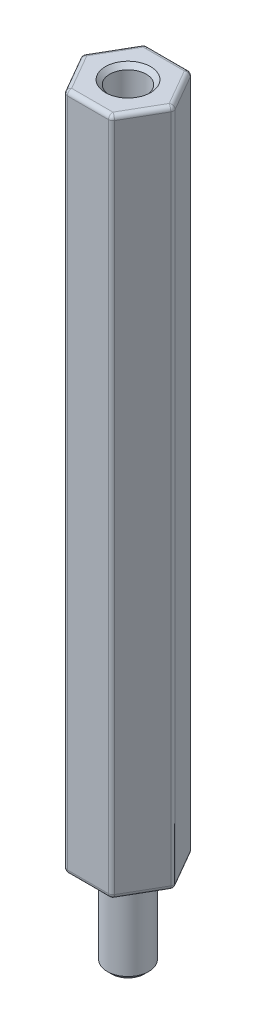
ISO-10303-21;
HEADER;
FILE_DESCRIPTION(('STEP AP214'),'2;1');
FILE_NAME('part.step','',(''),(''),'','','');
FILE_SCHEMA(('AUTOMOTIVE_DESIGN { 1 0 10303 214 1 1 1 1 }'));
ENDSEC;
DATA;
#1=APPLICATION_CONTEXT('core data for automotive mechanical design processes');
#2=APPLICATION_PROTOCOL_DEFINITION('international standard','automotive_design',2000,#1);
#3=PRODUCT_CONTEXT('',#1,'mechanical');
#4=PRODUCT('Part','Part','',(#3));
#5=PRODUCT_RELATED_PRODUCT_CATEGORY('part','',(#4));
#6=PRODUCT_DEFINITION_FORMATION('','',#4);
#7=PRODUCT_DEFINITION_CONTEXT('part definition',#1,'design');
#8=PRODUCT_DEFINITION('design','',#6,#7);
#9=PRODUCT_DEFINITION_SHAPE('','',#8);
#10=(LENGTH_UNIT() NAMED_UNIT(*) SI_UNIT(.MILLI.,.METRE.));
#11=(NAMED_UNIT(*) PLANE_ANGLE_UNIT() SI_UNIT($,.RADIAN.));
#12=(NAMED_UNIT(*) SI_UNIT($,.STERADIAN.) SOLID_ANGLE_UNIT());
#13=UNCERTAINTY_MEASURE_WITH_UNIT(LENGTH_MEASURE(1.E-05),#10,'distance_accuracy_value','');
#14=(GEOMETRIC_REPRESENTATION_CONTEXT(3) GLOBAL_UNCERTAINTY_ASSIGNED_CONTEXT((#13)) GLOBAL_UNIT_ASSIGNED_CONTEXT((#10,
#11,#12)) REPRESENTATION_CONTEXT('',''));
#15=CARTESIAN_POINT('',(0.,0.,0.));
#16=DIRECTION('',(0.,0.,1.));
#17=DIRECTION('',(1.,0.,0.));
#18=AXIS2_PLACEMENT_3D('',#15,#16,#17);
#19=CARTESIAN_POINT('',(0.,46.6,0.));
#20=DIRECTION('',(0.,1.,0.));
#21=DIRECTION('',(0.,0.,1.));
#22=AXIS2_PLACEMENT_3D('',#19,#20,#21);
#23=PLANE('',#22);
#24=CARTESIAN_POINT('',(0.,46.6,0.));
#25=DIRECTION('',(0.,1.,0.));
#26=DIRECTION('',(0.,0.,1.));
#27=AXIS2_PLACEMENT_3D('',#24,#25,#26);
#28=CIRCLE('',#27,1.55000000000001);
#29=CARTESIAN_POINT('',(0.,46.6,1.55000000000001));
#30=VERTEX_POINT('',#29);
#31=EDGE_CURVE('E319',#30,#30,#28,.F.);
#32=ORIENTED_EDGE('',*,*,#31,.T.);
#33=EDGE_LOOP('',(#32));
#34=FACE_BOUND('',#33,.T.);
#35=DIRECTION('',(-0.5,0.,0.866025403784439));
#36=VECTOR('',#35,1.);
#37=CARTESIAN_POINT('',(-2.82901631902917,46.6,0.));
#38=LINE('',#37,#36);
#39=CARTESIAN_POINT('',(-1.41450815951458,46.6,-2.45));
#40=VERTEX_POINT('',#39);
#41=CARTESIAN_POINT('',(-2.82901631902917,46.6,0.));
#42=VERTEX_POINT('',#41);
#43=EDGE_CURVE('E63',#40,#42,#38,.T.);
#44=ORIENTED_EDGE('',*,*,#43,.T.);
#45=DIRECTION('',(0.5,0.,0.866025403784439));
#46=VECTOR('',#45,1.);
#47=CARTESIAN_POINT('',(-1.41450815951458,46.6,2.45));
#48=LINE('',#47,#46);
#49=CARTESIAN_POINT('',(-1.41450815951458,46.6,2.45));
#50=VERTEX_POINT('',#49);
#51=EDGE_CURVE('E646',#42,#50,#48,.T.);
#52=ORIENTED_EDGE('',*,*,#51,.T.);
#53=DIRECTION('',(1.,0.,0.));
#54=VECTOR('',#53,1.);
#55=CARTESIAN_POINT('',(1.41450815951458,46.6,2.45));
#56=LINE('',#55,#54);
#57=CARTESIAN_POINT('',(1.41450815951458,46.6,2.45));
#58=VERTEX_POINT('',#57);
#59=EDGE_CURVE('E633',#50,#58,#56,.T.);
#60=ORIENTED_EDGE('',*,*,#59,.T.);
#61=DIRECTION('',(0.5,0.,-0.866025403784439));
#62=VECTOR('',#61,1.);
#63=CARTESIAN_POINT('',(2.82901631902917,46.6,0.));
#64=LINE('',#63,#62);
#65=CARTESIAN_POINT('',(2.82901631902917,46.6,0.));
#66=VERTEX_POINT('',#65);
#67=EDGE_CURVE('E636',#58,#66,#64,.T.);
#68=ORIENTED_EDGE('',*,*,#67,.T.);
#69=DIRECTION('',(-0.5,0.,-0.866025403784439));
#70=VECTOR('',#69,1.);
#71=CARTESIAN_POINT('',(1.41450815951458,46.6,-2.45));
#72=LINE('',#71,#70);
#73=CARTESIAN_POINT('',(1.41450815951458,46.6,-2.45));
#74=VERTEX_POINT('',#73);
#75=EDGE_CURVE('E639',#66,#74,#72,.T.);
#76=ORIENTED_EDGE('',*,*,#75,.T.);
#77=DIRECTION('',(-1.,0.,0.));
#78=VECTOR('',#77,1.);
#79=CARTESIAN_POINT('',(-1.41450815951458,46.6,-2.45));
#80=LINE('',#79,#78);
#81=EDGE_CURVE('E68',#74,#40,#80,.T.);
#82=ORIENTED_EDGE('',*,*,#81,.T.);
#83=EDGE_LOOP('',(#44,#52,#60,#68,#76,#82));
#84=FACE_BOUND('',#83,.T.);
#85=ADVANCED_FACE('F47',(#34,#84),#23,.T.);
#86=CARTESIAN_POINT('',(0.,0.,0.));
#87=DIRECTION('',(0.,1.,0.));
#88=DIRECTION('',(0.,0.,1.));
#89=AXIS2_PLACEMENT_3D('',#86,#87,#88);
#90=PLANE('',#89);
#91=CARTESIAN_POINT('',(0.,0.,0.));
#92=DIRECTION('',(0.,1.,0.));
#93=DIRECTION('',(0.,0.,1.));
#94=AXIS2_PLACEMENT_3D('',#91,#92,#93);
#95=CIRCLE('',#94,1.725);
#96=CARTESIAN_POINT('',(0.,0.,1.725));
#97=VERTEX_POINT('',#96);
#98=EDGE_CURVE('E11',#97,#97,#95,.T.);
#99=ORIENTED_EDGE('',*,*,#98,.T.);
#100=EDGE_LOOP('',(#99));
#101=FACE_BOUND('',#100,.T.);
#102=DIRECTION('',(1.,0.,0.));
#103=VECTOR('',#102,1.);
#104=CARTESIAN_POINT('',(0.,0.,2.45));
#105=LINE('',#104,#103);
#106=CARTESIAN_POINT('',(1.41450815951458,0.,2.45));
#107=VERTEX_POINT('',#106);
#108=CARTESIAN_POINT('',(-1.41450815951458,0.,2.45));
#109=VERTEX_POINT('',#108);
#110=EDGE_CURVE('E184',#107,#109,#105,.F.);
#111=ORIENTED_EDGE('',*,*,#110,.T.);
#112=DIRECTION('',(0.5,0.,0.866025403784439));
#113=VECTOR('',#112,1.);
#114=CARTESIAN_POINT('',(-2.12176223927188,0.,1.225));
#115=LINE('',#114,#113);
#116=CARTESIAN_POINT('',(-2.82901631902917,0.,0.));
#117=VERTEX_POINT('',#116);
#118=EDGE_CURVE('E212',#109,#117,#115,.F.);
#119=ORIENTED_EDGE('',*,*,#118,.T.);
#120=DIRECTION('',(-0.5,0.,0.866025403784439));
#121=VECTOR('',#120,1.);
#122=CARTESIAN_POINT('',(-2.12176223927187,0.,-1.225));
#123=LINE('',#122,#121);
#124=CARTESIAN_POINT('',(-1.41450815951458,0.,-2.45));
#125=VERTEX_POINT('',#124);
#126=EDGE_CURVE('E574',#117,#125,#123,.F.);
#127=ORIENTED_EDGE('',*,*,#126,.T.);
#128=DIRECTION('',(-1.,0.,0.));
#129=VECTOR('',#128,1.);
#130=CARTESIAN_POINT('',(0.,0.,-2.45));
#131=LINE('',#130,#129);
#132=CARTESIAN_POINT('',(1.41450815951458,0.,-2.45));
#133=VERTEX_POINT('',#132);
#134=EDGE_CURVE('E571',#125,#133,#131,.F.);
#135=ORIENTED_EDGE('',*,*,#134,.T.);
#136=DIRECTION('',(-0.5,0.,-0.866025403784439));
#137=VECTOR('',#136,1.);
#138=CARTESIAN_POINT('',(2.12176223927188,0.,-1.225));
#139=LINE('',#138,#137);
#140=CARTESIAN_POINT('',(2.82901631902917,0.,0.));
#141=VERTEX_POINT('',#140);
#142=EDGE_CURVE('E568',#133,#141,#139,.F.);
#143=ORIENTED_EDGE('',*,*,#142,.T.);
#144=DIRECTION('',(0.5,0.,-0.866025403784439));
#145=VECTOR('',#144,1.);
#146=CARTESIAN_POINT('',(2.12176223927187,0.,1.225));
#147=LINE('',#146,#145);
#148=EDGE_CURVE('E565',#141,#107,#147,.F.);
#149=ORIENTED_EDGE('',*,*,#148,.T.);
#150=EDGE_LOOP('',(#111,#119,#127,#135,#143,#149));
#151=FACE_BOUND('',#150,.T.);
#152=ADVANCED_FACE('F339',(#101,#151),#90,.F.);
#153=CARTESIAN_POINT('',(1.58771324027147,46.6,-2.75));
#154=DIRECTION('',(0.,0.,1.));
#155=DIRECTION('',(1.,0.,0.));
#156=AXIS2_PLACEMENT_3D('',#153,#154,#155);
#157=PLANE('',#156);
#158=DIRECTION('',(0.,-1.,0.));
#159=VECTOR('',#158,1.);
#160=CARTESIAN_POINT('',(1.41450815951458,46.6,-2.75));
#161=LINE('',#160,#159);
#162=CARTESIAN_POINT('',(1.41450815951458,46.3,-2.75));
#163=VERTEX_POINT('',#162);
#164=CARTESIAN_POINT('',(1.41450815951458,0.300000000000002,-2.75));
#165=VERTEX_POINT('',#164);
#166=EDGE_CURVE('E521',#163,#165,#161,.T.);
#167=ORIENTED_EDGE('',*,*,#166,.T.);
#168=DIRECTION('',(-1.,0.,0.));
#169=VECTOR('',#168,1.);
#170=CARTESIAN_POINT('',(1.58771324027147,0.300000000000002,-2.75));
#171=LINE('',#170,#169);
#172=CARTESIAN_POINT('',(-1.41450815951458,0.300000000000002,-2.75));
#173=VERTEX_POINT('',#172);
#174=EDGE_CURVE('E600',#165,#173,#171,.T.);
#175=ORIENTED_EDGE('',*,*,#174,.T.);
#176=DIRECTION('',(0.,-1.,0.));
#177=VECTOR('',#176,1.);
#178=CARTESIAN_POINT('',(-1.41450815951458,46.6,-2.75));
#179=LINE('',#178,#177);
#180=CARTESIAN_POINT('',(-1.41450815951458,46.3,-2.75));
#181=VERTEX_POINT('',#180);
#182=EDGE_CURVE('E517',#173,#181,#179,.F.);
#183=ORIENTED_EDGE('',*,*,#182,.T.);
#184=DIRECTION('',(-1.,0.,0.));
#185=VECTOR('',#184,1.);
#186=CARTESIAN_POINT('',(1.41450815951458,46.3,-2.75));
#187=LINE('',#186,#185);
#188=EDGE_CURVE('E597',#181,#163,#187,.F.);
#189=ORIENTED_EDGE('',*,*,#188,.T.);
#190=EDGE_LOOP('',(#167,#175,#183,#189));
#191=FACE_BOUND('',#190,.T.);
#192=ADVANCED_FACE('F345',(#191),#157,.F.);
#193=CARTESIAN_POINT('',(-1.58771324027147,46.6,-2.75));
#194=DIRECTION('',(0.866025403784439,0.,0.5));
#195=DIRECTION('',(0.5,0.,-0.866025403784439));
#196=AXIS2_PLACEMENT_3D('',#193,#194,#195);
#197=PLANE('',#196);
#198=DIRECTION('',(0.,-1.,0.));
#199=VECTOR('',#198,1.);
#200=CARTESIAN_POINT('',(-1.67431578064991,46.6,-2.6));
#201=LINE('',#200,#199);
#202=CARTESIAN_POINT('',(-1.67431578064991,46.3,-2.6));
#203=VERTEX_POINT('',#202);
#204=CARTESIAN_POINT('',(-1.67431578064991,0.300000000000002,-2.6));
#205=VERTEX_POINT('',#204);
#206=EDGE_CURVE('E198',#203,#205,#201,.T.);
#207=ORIENTED_EDGE('',*,*,#206,.T.);
#208=DIRECTION('',(-0.5,0.,0.866025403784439));
#209=VECTOR('',#208,1.);
#210=CARTESIAN_POINT('',(-1.58771324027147,0.300000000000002,-2.75));
#211=LINE('',#210,#209);
#212=CARTESIAN_POINT('',(-3.0888239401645,0.300000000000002,-0.15));
#213=VERTEX_POINT('',#212);
#214=EDGE_CURVE('E588',#205,#213,#211,.T.);
#215=ORIENTED_EDGE('',*,*,#214,.T.);
#216=DIRECTION('',(0.,-1.,0.));
#217=VECTOR('',#216,1.);
#218=CARTESIAN_POINT('',(-3.0888239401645,46.6,-0.15));
#219=LINE('',#218,#217);
#220=CARTESIAN_POINT('',(-3.0888239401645,46.3,-0.15));
#221=VERTEX_POINT('',#220);
#222=EDGE_CURVE('E543',#213,#221,#219,.F.);
#223=ORIENTED_EDGE('',*,*,#222,.T.);
#224=DIRECTION('',(-0.5,0.,0.866025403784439));
#225=VECTOR('',#224,1.);
#226=CARTESIAN_POINT('',(-1.67431578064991,46.3,-2.6));
#227=LINE('',#226,#225);
#228=EDGE_CURVE('E585',#221,#203,#227,.F.);
#229=ORIENTED_EDGE('',*,*,#228,.T.);
#230=EDGE_LOOP('',(#207,#215,#223,#229));
#231=FACE_BOUND('',#230,.T.);
#232=ADVANCED_FACE('F366',(#231),#197,.F.);
#233=CARTESIAN_POINT('',(-3.17542648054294,46.6,0.));
#234=DIRECTION('',(0.866025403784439,0.,-0.5));
#235=DIRECTION('',(-0.5,0.,-0.866025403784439));
#236=AXIS2_PLACEMENT_3D('',#233,#234,#235);
#237=PLANE('',#236);
#238=DIRECTION('',(0.,-1.,0.));
#239=VECTOR('',#238,1.);
#240=CARTESIAN_POINT('',(-3.0888239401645,46.6,0.15));
#241=LINE('',#240,#239);
#242=CARTESIAN_POINT('',(-3.0888239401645,46.3,0.15));
#243=VERTEX_POINT('',#242);
#244=CARTESIAN_POINT('',(-3.0888239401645,0.300000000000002,0.15));
#245=VERTEX_POINT('',#244);
#246=EDGE_CURVE('E179',#243,#245,#241,.T.);
#247=ORIENTED_EDGE('',*,*,#246,.T.);
#248=DIRECTION('',(0.5,0.,0.866025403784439));
#249=VECTOR('',#248,1.);
#250=CARTESIAN_POINT('',(-3.17542648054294,0.300000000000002,0.));
#251=LINE('',#250,#249);
#252=CARTESIAN_POINT('',(-1.67431578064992,0.300000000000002,2.6));
#253=VERTEX_POINT('',#252);
#254=EDGE_CURVE('E174',#245,#253,#251,.T.);
#255=ORIENTED_EDGE('',*,*,#254,.T.);
#256=DIRECTION('',(0.,-1.,0.));
#257=VECTOR('',#256,1.);
#258=CARTESIAN_POINT('',(-1.67431578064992,46.6,2.6));
#259=LINE('',#258,#257);
#260=CARTESIAN_POINT('',(-1.67431578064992,46.3,2.6));
#261=VERTEX_POINT('',#260);
#262=EDGE_CURVE('E177',#253,#261,#259,.F.);
#263=ORIENTED_EDGE('',*,*,#262,.T.);
#264=DIRECTION('',(0.5,0.,0.866025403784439));
#265=VECTOR('',#264,1.);
#266=CARTESIAN_POINT('',(-3.0888239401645,46.3,0.15));
#267=LINE('',#266,#265);
#268=EDGE_CURVE('E185',#261,#243,#267,.F.);
#269=ORIENTED_EDGE('',*,*,#268,.T.);
#270=EDGE_LOOP('',(#247,#255,#263,#269));
#271=FACE_BOUND('',#270,.T.);
#272=ADVANCED_FACE('F176',(#271),#237,.F.);
#273=CARTESIAN_POINT('',(-1.58771324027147,46.6,2.75));
#274=DIRECTION('',(0.,0.,-1.));
#275=DIRECTION('',(-1.,0.,0.));
#276=AXIS2_PLACEMENT_3D('',#273,#274,#275);
#277=PLANE('',#276);
#278=DIRECTION('',(0.,-1.,0.));
#279=VECTOR('',#278,1.);
#280=CARTESIAN_POINT('',(-1.41450815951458,46.6,2.75));
#281=LINE('',#280,#279);
#282=CARTESIAN_POINT('',(-1.41450815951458,46.3,2.75));
#283=VERTEX_POINT('',#282);
#284=CARTESIAN_POINT('',(-1.41450815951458,0.300000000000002,2.75));
#285=VERTEX_POINT('',#284);
#286=EDGE_CURVE('E556',#283,#285,#281,.T.);
#287=ORIENTED_EDGE('',*,*,#286,.T.);
#288=DIRECTION('',(1.,0.,0.));
#289=VECTOR('',#288,1.);
#290=CARTESIAN_POINT('',(-1.58771324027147,0.300000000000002,2.75));
#291=LINE('',#290,#289);
#292=CARTESIAN_POINT('',(1.41450815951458,0.300000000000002,2.75));
#293=VERTEX_POINT('',#292);
#294=EDGE_CURVE('E224',#285,#293,#291,.T.);
#295=ORIENTED_EDGE('',*,*,#294,.T.);
#296=DIRECTION('',(0.,-1.,0.));
#297=VECTOR('',#296,1.);
#298=CARTESIAN_POINT('',(1.41450815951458,46.6,2.75));
#299=LINE('',#298,#297);
#300=CARTESIAN_POINT('',(1.41450815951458,46.3,2.75));
#301=VERTEX_POINT('',#300);
#302=EDGE_CURVE('E552',#293,#301,#299,.F.);
#303=ORIENTED_EDGE('',*,*,#302,.T.);
#304=DIRECTION('',(1.,0.,0.));
#305=VECTOR('',#304,1.);
#306=CARTESIAN_POINT('',(-1.41450815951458,46.3,2.75));
#307=LINE('',#306,#305);
#308=EDGE_CURVE('E648',#301,#283,#307,.F.);
#309=ORIENTED_EDGE('',*,*,#308,.T.);
#310=EDGE_LOOP('',(#287,#295,#303,#309));
#311=FACE_BOUND('',#310,.T.);
#312=ADVANCED_FACE('F359',(#311),#277,.F.);
#313=CARTESIAN_POINT('',(1.58771324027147,46.6,2.75));
#314=DIRECTION('',(-0.866025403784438,0.,-0.5));
#315=DIRECTION('',(-0.5,0.,0.866025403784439));
#316=AXIS2_PLACEMENT_3D('',#313,#314,#315);
#317=PLANE('',#316);
#318=DIRECTION('',(0.,-1.,0.));
#319=VECTOR('',#318,1.);
#320=CARTESIAN_POINT('',(1.67431578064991,46.6,2.6));
#321=LINE('',#320,#319);
#322=CARTESIAN_POINT('',(1.67431578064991,46.3,2.6));
#323=VERTEX_POINT('',#322);
#324=CARTESIAN_POINT('',(1.67431578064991,0.300000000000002,2.6));
#325=VERTEX_POINT('',#324);
#326=EDGE_CURVE('E535',#323,#325,#321,.T.);
#327=ORIENTED_EDGE('',*,*,#326,.T.);
#328=DIRECTION('',(0.5,0.,-0.866025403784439));
#329=VECTOR('',#328,1.);
#330=CARTESIAN_POINT('',(1.58771324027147,0.300000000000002,2.75));
#331=LINE('',#330,#329);
#332=CARTESIAN_POINT('',(3.0888239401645,0.300000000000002,0.149999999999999));
#333=VERTEX_POINT('',#332);
#334=EDGE_CURVE('E624',#325,#333,#331,.T.);
#335=ORIENTED_EDGE('',*,*,#334,.T.);
#336=DIRECTION('',(0.,-1.,0.));
#337=VECTOR('',#336,1.);
#338=CARTESIAN_POINT('',(3.0888239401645,46.6,0.149999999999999));
#339=LINE('',#338,#337);
#340=CARTESIAN_POINT('',(3.0888239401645,46.3,0.149999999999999));
#341=VERTEX_POINT('',#340);
#342=EDGE_CURVE('E539',#333,#341,#339,.F.);
#343=ORIENTED_EDGE('',*,*,#342,.T.);
#344=DIRECTION('',(0.5,0.,-0.866025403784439));
#345=VECTOR('',#344,1.);
#346=CARTESIAN_POINT('',(1.67431578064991,46.3,2.6));
#347=LINE('',#346,#345);
#348=EDGE_CURVE('E621',#341,#323,#347,.F.);
#349=ORIENTED_EDGE('',*,*,#348,.T.);
#350=EDGE_LOOP('',(#327,#335,#343,#349));
#351=FACE_BOUND('',#350,.T.);
#352=ADVANCED_FACE('F355',(#351),#317,.F.);
#353=CARTESIAN_POINT('',(3.17542648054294,46.6,0.));
#354=DIRECTION('',(-0.866025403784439,0.,0.5));
#355=DIRECTION('',(0.5,0.,0.866025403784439));
#356=AXIS2_PLACEMENT_3D('',#353,#354,#355);
#357=PLANE('',#356);
#358=DIRECTION('',(0.,-1.,0.));
#359=VECTOR('',#358,1.);
#360=CARTESIAN_POINT('',(3.0888239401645,46.6,-0.150000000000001));
#361=LINE('',#360,#359);
#362=CARTESIAN_POINT('',(3.0888239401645,46.3,-0.150000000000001));
#363=VERTEX_POINT('',#362);
#364=CARTESIAN_POINT('',(3.0888239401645,0.300000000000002,-0.150000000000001));
#365=VERTEX_POINT('',#364);
#366=EDGE_CURVE('E527',#363,#365,#361,.T.);
#367=ORIENTED_EDGE('',*,*,#366,.T.);
#368=DIRECTION('',(-0.5,0.,-0.866025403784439));
#369=VECTOR('',#368,1.);
#370=CARTESIAN_POINT('',(3.17542648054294,0.300000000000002,0.));
#371=LINE('',#370,#369);
#372=CARTESIAN_POINT('',(1.67431578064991,0.300000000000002,-2.6));
#373=VERTEX_POINT('',#372);
#374=EDGE_CURVE('E612',#365,#373,#371,.T.);
#375=ORIENTED_EDGE('',*,*,#374,.T.);
#376=DIRECTION('',(0.,-1.,0.));
#377=VECTOR('',#376,1.);
#378=CARTESIAN_POINT('',(1.67431578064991,46.6,-2.6));
#379=LINE('',#378,#377);
#380=CARTESIAN_POINT('',(1.67431578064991,46.3,-2.6));
#381=VERTEX_POINT('',#380);
#382=EDGE_CURVE('E531',#373,#381,#379,.F.);
#383=ORIENTED_EDGE('',*,*,#382,.T.);
#384=DIRECTION('',(-0.5,0.,-0.866025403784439));
#385=VECTOR('',#384,1.);
#386=CARTESIAN_POINT('',(3.0888239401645,46.3,-0.150000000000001));
#387=LINE('',#386,#385);
#388=EDGE_CURVE('E609',#381,#363,#387,.F.);
#389=ORIENTED_EDGE('',*,*,#388,.T.);
#390=EDGE_LOOP('',(#367,#375,#383,#389));
#391=FACE_BOUND('',#390,.T.);
#392=ADVANCED_FACE('F352',(#391),#357,.F.);
#393=CARTESIAN_POINT('',(0.,46.6,0.));
#394=DIRECTION('',(0.,-1.,0.));
#395=DIRECTION('',(0.,0.,-1.));
#396=AXIS2_PLACEMENT_3D('',#393,#394,#395);
#397=CYLINDRICAL_SURFACE('',#396,1.25);
#398=CARTESIAN_POINT('',(0.,46.3,0.));
#399=DIRECTION('',(0.,1.,0.));
#400=DIRECTION('',(0.,0.,1.));
#401=AXIS2_PLACEMENT_3D('',#398,#399,#400);
#402=CIRCLE('',#401,1.25);
#403=CARTESIAN_POINT('',(0.,46.3,1.25));
#404=VERTEX_POINT('',#403);
#405=EDGE_CURVE('E315',#404,#404,#402,.T.);
#406=ORIENTED_EDGE('',*,*,#405,.T.);
#407=EDGE_LOOP('',(#406));
#408=FACE_BOUND('',#407,.T.);
#409=CARTESIAN_POINT('',(0.,0.,0.));
#410=DIRECTION('',(0.,1.,0.));
#411=DIRECTION('',(0.,0.,1.));
#412=AXIS2_PLACEMENT_3D('',#409,#410,#411);
#413=CIRCLE('',#412,1.25);
#414=CARTESIAN_POINT('',(0.,0.,1.25));
#415=VERTEX_POINT('',#414);
#416=EDGE_CURVE('E265',#415,#415,#413,.T.);
#417=ORIENTED_EDGE('',*,*,#416,.F.);
#418=EDGE_LOOP('',(#417));
#419=FACE_BOUND('',#418,.T.);
#420=ADVANCED_FACE('F349',(#408,#419),#397,.F.);
#421=CARTESIAN_POINT('',(1.41450815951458,46.6,-2.45));
#422=DIRECTION('',(0.,-1.,0.));
#423=DIRECTION('',(0.,0.,-1.));
#424=AXIS2_PLACEMENT_3D('',#421,#422,#423);
#425=CYLINDRICAL_SURFACE('',#424,0.3);
#426=ORIENTED_EDGE('',*,*,#382,.F.);
#427=CARTESIAN_POINT('',(1.41450815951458,0.300000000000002,-2.45));
#428=DIRECTION('',(0.,-1.,0.));
#429=DIRECTION('',(0.,0.,-1.));
#430=AXIS2_PLACEMENT_3D('',#427,#428,#429);
#431=CIRCLE('',#430,0.3);
#432=EDGE_CURVE('E606',#373,#165,#431,.F.);
#433=ORIENTED_EDGE('',*,*,#432,.T.);
#434=ORIENTED_EDGE('',*,*,#166,.F.);
#435=CARTESIAN_POINT('',(1.41450815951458,46.3,-2.45));
#436=DIRECTION('',(0.,-1.,0.));
#437=DIRECTION('',(0.,0.,-1.));
#438=AXIS2_PLACEMENT_3D('',#435,#436,#437);
#439=CIRCLE('',#438,0.3);
#440=EDGE_CURVE('E603',#163,#381,#439,.T.);
#441=ORIENTED_EDGE('',*,*,#440,.T.);
#442=EDGE_LOOP('',(#426,#433,#434,#441));
#443=FACE_BOUND('',#442,.T.);
#444=ADVANCED_FACE('F373',(#443),#425,.T.);
#445=CARTESIAN_POINT('',(2.82901631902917,46.6,0.));
#446=DIRECTION('',(0.,-1.,0.));
#447=DIRECTION('',(0.,0.,-1.));
#448=AXIS2_PLACEMENT_3D('',#445,#446,#447);
#449=CYLINDRICAL_SURFACE('',#448,0.3);
#450=ORIENTED_EDGE('',*,*,#342,.F.);
#451=CARTESIAN_POINT('',(2.82901631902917,0.300000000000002,0.));
#452=DIRECTION('',(0.,-1.,0.));
#453=DIRECTION('',(0.,0.,-1.));
#454=AXIS2_PLACEMENT_3D('',#451,#452,#453);
#455=CIRCLE('',#454,0.3);
#456=EDGE_CURVE('E618',#333,#365,#455,.F.);
#457=ORIENTED_EDGE('',*,*,#456,.T.);
#458=ORIENTED_EDGE('',*,*,#366,.F.);
#459=CARTESIAN_POINT('',(2.82901631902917,46.3,0.));
#460=DIRECTION('',(0.,-1.,0.));
#461=DIRECTION('',(0.,0.,-1.));
#462=AXIS2_PLACEMENT_3D('',#459,#460,#461);
#463=CIRCLE('',#462,0.3);
#464=EDGE_CURVE('E615',#363,#341,#463,.T.);
#465=ORIENTED_EDGE('',*,*,#464,.T.);
#466=EDGE_LOOP('',(#450,#457,#458,#465));
#467=FACE_BOUND('',#466,.T.);
#468=ADVANCED_FACE('F376',(#467),#449,.T.);
#469=CARTESIAN_POINT('',(-1.41450815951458,46.6,-2.45));
#470=DIRECTION('',(0.,-1.,0.));
#471=DIRECTION('',(0.,0.,-1.));
#472=AXIS2_PLACEMENT_3D('',#469,#470,#471);
#473=CYLINDRICAL_SURFACE('',#472,0.3);
#474=ORIENTED_EDGE('',*,*,#182,.F.);
#475=CARTESIAN_POINT('',(-1.41450815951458,0.300000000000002,-2.45));
#476=DIRECTION('',(0.,-1.,0.));
#477=DIRECTION('',(0.,0.,-1.));
#478=AXIS2_PLACEMENT_3D('',#475,#476,#477);
#479=CIRCLE('',#478,0.3);
#480=EDGE_CURVE('E594',#173,#205,#479,.F.);
#481=ORIENTED_EDGE('',*,*,#480,.T.);
#482=ORIENTED_EDGE('',*,*,#206,.F.);
#483=CARTESIAN_POINT('',(-1.41450815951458,46.3,-2.45));
#484=DIRECTION('',(0.,-1.,0.));
#485=DIRECTION('',(0.,0.,-1.));
#486=AXIS2_PLACEMENT_3D('',#483,#484,#485);
#487=CIRCLE('',#486,0.3);
#488=EDGE_CURVE('E591',#203,#181,#487,.T.);
#489=ORIENTED_EDGE('',*,*,#488,.T.);
#490=EDGE_LOOP('',(#474,#481,#482,#489));
#491=FACE_BOUND('',#490,.T.);
#492=ADVANCED_FACE('F380',(#491),#473,.T.);
#493=CARTESIAN_POINT('',(-2.82901631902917,46.6,0.));
#494=DIRECTION('',(0.,-1.,0.));
#495=DIRECTION('',(0.,0.,-1.));
#496=AXIS2_PLACEMENT_3D('',#493,#494,#495);
#497=CYLINDRICAL_SURFACE('',#496,0.3);
#498=ORIENTED_EDGE('',*,*,#222,.F.);
#499=CARTESIAN_POINT('',(-2.82901631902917,0.300000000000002,0.));
#500=DIRECTION('',(0.,-1.,0.));
#501=DIRECTION('',(0.,0.,-1.));
#502=AXIS2_PLACEMENT_3D('',#499,#500,#501);
#503=CIRCLE('',#502,0.3);
#504=EDGE_CURVE('E582',#213,#245,#503,.F.);
#505=ORIENTED_EDGE('',*,*,#504,.T.);
#506=ORIENTED_EDGE('',*,*,#246,.F.);
#507=CARTESIAN_POINT('',(-2.82901631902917,46.3,0.));
#508=DIRECTION('',(0.,-1.,0.));
#509=DIRECTION('',(0.,0.,-1.));
#510=AXIS2_PLACEMENT_3D('',#507,#508,#509);
#511=CIRCLE('',#510,0.3);
#512=EDGE_CURVE('E579',#243,#221,#511,.T.);
#513=ORIENTED_EDGE('',*,*,#512,.T.);
#514=EDGE_LOOP('',(#498,#505,#506,#513));
#515=FACE_BOUND('',#514,.T.);
#516=ADVANCED_FACE('F384',(#515),#497,.T.);
#517=CARTESIAN_POINT('',(-1.41450815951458,46.6,2.45));
#518=DIRECTION('',(0.,-1.,0.));
#519=DIRECTION('',(0.,0.,-1.));
#520=AXIS2_PLACEMENT_3D('',#517,#518,#519);
#521=CYLINDRICAL_SURFACE('',#520,0.3);
#522=ORIENTED_EDGE('',*,*,#262,.F.);
#523=CARTESIAN_POINT('',(-1.41450815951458,0.300000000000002,2.45));
#524=DIRECTION('',(0.,-1.,0.));
#525=DIRECTION('',(0.,0.,-1.));
#526=AXIS2_PLACEMENT_3D('',#523,#524,#525);
#527=CIRCLE('',#526,0.3);
#528=EDGE_CURVE('E193',#253,#285,#527,.F.);
#529=ORIENTED_EDGE('',*,*,#528,.T.);
#530=ORIENTED_EDGE('',*,*,#286,.F.);
#531=CARTESIAN_POINT('',(-1.41450815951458,46.3,2.45));
#532=DIRECTION('',(0.,-1.,0.));
#533=DIRECTION('',(0.,0.,-1.));
#534=AXIS2_PLACEMENT_3D('',#531,#532,#533);
#535=CIRCLE('',#534,0.3);
#536=EDGE_CURVE('E196',#283,#261,#535,.T.);
#537=ORIENTED_EDGE('',*,*,#536,.T.);
#538=EDGE_LOOP('',(#522,#529,#530,#537));
#539=FACE_BOUND('',#538,.T.);
#540=ADVANCED_FACE('F191',(#539),#521,.T.);
#541=CARTESIAN_POINT('',(1.41450815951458,46.6,2.45));
#542=DIRECTION('',(0.,-1.,0.));
#543=DIRECTION('',(0.,0.,-1.));
#544=AXIS2_PLACEMENT_3D('',#541,#542,#543);
#545=CYLINDRICAL_SURFACE('',#544,0.3);
#546=ORIENTED_EDGE('',*,*,#302,.F.);
#547=CARTESIAN_POINT('',(1.41450815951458,0.300000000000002,2.45));
#548=DIRECTION('',(0.,-1.,0.));
#549=DIRECTION('',(0.,0.,-1.));
#550=AXIS2_PLACEMENT_3D('',#547,#548,#549);
#551=CIRCLE('',#550,0.3);
#552=EDGE_CURVE('E630',#293,#325,#551,.F.);
#553=ORIENTED_EDGE('',*,*,#552,.T.);
#554=ORIENTED_EDGE('',*,*,#326,.F.);
#555=CARTESIAN_POINT('',(1.41450815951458,46.3,2.45));
#556=DIRECTION('',(0.,-1.,0.));
#557=DIRECTION('',(0.,0.,-1.));
#558=AXIS2_PLACEMENT_3D('',#555,#556,#557);
#559=CIRCLE('',#558,0.3);
#560=EDGE_CURVE('E627',#323,#301,#559,.T.);
#561=ORIENTED_EDGE('',*,*,#560,.T.);
#562=EDGE_LOOP('',(#546,#553,#554,#561));
#563=FACE_BOUND('',#562,.T.);
#564=ADVANCED_FACE('F391',(#563),#545,.T.);
#565=CARTESIAN_POINT('',(1.41450815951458,0.300000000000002,-2.45));
#566=DIRECTION('',(0.,1.,0.));
#567=DIRECTION('',(0.,0.,1.));
#568=AXIS2_PLACEMENT_3D('',#565,#566,#567);
#569=SPHERICAL_SURFACE('',#568,0.3);
#570=CARTESIAN_POINT('',(1.41450815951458,0.300000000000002,-2.45));
#571=DIRECTION('',(-1.,0.,0.));
#572=DIRECTION('',(0.,0.,1.));
#573=AXIS2_PLACEMENT_3D('',#570,#571,#572);
#574=CIRCLE('',#573,0.3);
#575=EDGE_CURVE('E257',#165,#133,#574,.T.);
#576=ORIENTED_EDGE('',*,*,#575,.F.);
#577=ORIENTED_EDGE('',*,*,#432,.F.);
#578=CARTESIAN_POINT('',(1.41450815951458,0.300000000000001,-2.45));
#579=DIRECTION('',(0.500000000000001,0.,0.866025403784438));
#580=DIRECTION('',(0.866025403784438,0.,-0.500000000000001));
#581=AXIS2_PLACEMENT_3D('',#578,#579,#580);
#582=CIRCLE('',#581,0.3);
#583=EDGE_CURVE('E261',#133,#373,#582,.T.);
#584=ORIENTED_EDGE('',*,*,#583,.F.);
#585=EDGE_LOOP('',(#576,#577,#584));
#586=FACE_BOUND('',#585,.T.);
#587=ADVANCED_FACE('F394',(#586),#569,.T.);
#588=CARTESIAN_POINT('',(2.91561885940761,0.300000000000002,0.15));
#589=DIRECTION('',(-0.5,0.,-0.866025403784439));
#590=DIRECTION('',(-0.866025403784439,0.,0.5));
#591=AXIS2_PLACEMENT_3D('',#588,#589,#590);
#592=CYLINDRICAL_SURFACE('',#591,0.3);
#593=ORIENTED_EDGE('',*,*,#583,.T.);
#594=ORIENTED_EDGE('',*,*,#374,.F.);
#595=CARTESIAN_POINT('',(2.82901631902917,0.3,0.));
#596=DIRECTION('',(0.5,0.,0.866025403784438));
#597=DIRECTION('',(0.866025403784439,0.,-0.5));
#598=AXIS2_PLACEMENT_3D('',#595,#596,#597);
#599=CIRCLE('',#598,0.3);
#600=EDGE_CURVE('E253',#141,#365,#599,.T.);
#601=ORIENTED_EDGE('',*,*,#600,.F.);
#602=ORIENTED_EDGE('',*,*,#142,.F.);
#603=EDGE_LOOP('',(#593,#594,#601,#602));
#604=FACE_BOUND('',#603,.T.);
#605=ADVANCED_FACE('F432',(#604),#592,.T.);
#606=CARTESIAN_POINT('',(1.58771324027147,0.300000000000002,-2.45));
#607=DIRECTION('',(-1.,0.,0.));
#608=DIRECTION('',(0.,0.,1.));
#609=AXIS2_PLACEMENT_3D('',#606,#607,#608);
#610=CYLINDRICAL_SURFACE('',#609,0.3);
#611=ORIENTED_EDGE('',*,*,#575,.T.);
#612=ORIENTED_EDGE('',*,*,#134,.F.);
#613=CARTESIAN_POINT('',(-1.41450815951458,0.300000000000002,-2.45));
#614=DIRECTION('',(-1.,0.,0.));
#615=DIRECTION('',(0.,-1.,0.));
#616=AXIS2_PLACEMENT_3D('',#613,#614,#615);
#617=CIRCLE('',#616,0.3);
#618=EDGE_CURVE('E249',#173,#125,#617,.T.);
#619=ORIENTED_EDGE('',*,*,#618,.F.);
#620=ORIENTED_EDGE('',*,*,#174,.F.);
#621=EDGE_LOOP('',(#611,#612,#619,#620));
#622=FACE_BOUND('',#621,.T.);
#623=ADVANCED_FACE('F428',(#622),#610,.T.);
#624=CARTESIAN_POINT('',(2.82901631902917,0.300000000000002,0.));
#625=DIRECTION('',(0.,1.,0.));
#626=DIRECTION('',(0.,0.,1.));
#627=AXIS2_PLACEMENT_3D('',#624,#625,#626);
#628=SPHERICAL_SURFACE('',#627,0.3);
#629=ORIENTED_EDGE('',*,*,#600,.T.);
#630=ORIENTED_EDGE('',*,*,#456,.F.);
#631=CARTESIAN_POINT('',(2.82901631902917,0.300000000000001,0.));
#632=DIRECTION('',(-0.499999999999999,0.,0.866025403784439));
#633=DIRECTION('',(0.866025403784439,0.,0.499999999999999));
#634=AXIS2_PLACEMENT_3D('',#631,#632,#633);
#635=CIRCLE('',#634,0.3);
#636=EDGE_CURVE('E245',#141,#333,#635,.T.);
#637=ORIENTED_EDGE('',*,*,#636,.F.);
#638=EDGE_LOOP('',(#629,#630,#637));
#639=FACE_BOUND('',#638,.T.);
#640=ADVANCED_FACE('F424',(#639),#628,.T.);
#641=CARTESIAN_POINT('',(-1.41450815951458,0.300000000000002,-2.45));
#642=DIRECTION('',(0.,1.,0.));
#643=DIRECTION('',(0.,0.,1.));
#644=AXIS2_PLACEMENT_3D('',#641,#642,#643);
#645=SPHERICAL_SURFACE('',#644,0.3);
#646=ORIENTED_EDGE('',*,*,#480,.F.);
#647=ORIENTED_EDGE('',*,*,#618,.T.);
#648=CARTESIAN_POINT('',(-1.41450815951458,0.300000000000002,-2.45));
#649=DIRECTION('',(-0.5,0.,0.866025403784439));
#650=DIRECTION('',(0.866025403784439,0.,0.5));
#651=AXIS2_PLACEMENT_3D('',#648,#649,#650);
#652=CIRCLE('',#651,0.3);
#653=EDGE_CURVE('E241',#205,#125,#652,.T.);
#654=ORIENTED_EDGE('',*,*,#653,.F.);
#655=EDGE_LOOP('',(#646,#647,#654));
#656=FACE_BOUND('',#655,.T.);
#657=ADVANCED_FACE('F420',(#656),#645,.T.);
#658=CARTESIAN_POINT('',(1.32790561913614,0.300000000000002,2.6));
#659=DIRECTION('',(0.5,0.,-0.866025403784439));
#660=DIRECTION('',(-0.866025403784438,0.,-0.5));
#661=AXIS2_PLACEMENT_3D('',#658,#659,#660);
#662=CYLINDRICAL_SURFACE('',#661,0.3);
#663=ORIENTED_EDGE('',*,*,#636,.T.);
#664=ORIENTED_EDGE('',*,*,#334,.F.);
#665=CARTESIAN_POINT('',(1.41450815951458,0.3,2.45));
#666=DIRECTION('',(-0.5,0.,0.866025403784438));
#667=DIRECTION('',(0.866025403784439,0.,0.5));
#668=AXIS2_PLACEMENT_3D('',#665,#666,#667);
#669=CIRCLE('',#668,0.3);
#670=EDGE_CURVE('E237',#107,#325,#669,.T.);
#671=ORIENTED_EDGE('',*,*,#670,.F.);
#672=ORIENTED_EDGE('',*,*,#148,.F.);
#673=EDGE_LOOP('',(#663,#664,#671,#672));
#674=FACE_BOUND('',#673,.T.);
#675=ADVANCED_FACE('F416',(#674),#662,.T.);
#676=CARTESIAN_POINT('',(-1.32790561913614,0.300000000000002,-2.6));
#677=DIRECTION('',(-0.5,0.,0.866025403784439));
#678=DIRECTION('',(0.866025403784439,0.,0.5));
#679=AXIS2_PLACEMENT_3D('',#676,#677,#678);
#680=CYLINDRICAL_SURFACE('',#679,0.3);
#681=ORIENTED_EDGE('',*,*,#653,.T.);
#682=ORIENTED_EDGE('',*,*,#126,.F.);
#683=CARTESIAN_POINT('',(-2.82901631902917,0.300000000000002,0.));
#684=DIRECTION('',(-0.5,0.,0.866025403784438));
#685=DIRECTION('',(0.866025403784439,0.,0.5));
#686=AXIS2_PLACEMENT_3D('',#683,#684,#685);
#687=CIRCLE('',#686,0.3);
#688=EDGE_CURVE('E233',#213,#117,#687,.T.);
#689=ORIENTED_EDGE('',*,*,#688,.F.);
#690=ORIENTED_EDGE('',*,*,#214,.F.);
#691=EDGE_LOOP('',(#681,#682,#689,#690));
#692=FACE_BOUND('',#691,.T.);
#693=ADVANCED_FACE('F412',(#692),#680,.T.);
#694=CARTESIAN_POINT('',(1.41450815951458,0.300000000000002,2.45));
#695=DIRECTION('',(0.,1.,0.));
#696=DIRECTION('',(0.,0.,1.));
#697=AXIS2_PLACEMENT_3D('',#694,#695,#696);
#698=SPHERICAL_SURFACE('',#697,0.3);
#699=ORIENTED_EDGE('',*,*,#670,.T.);
#700=ORIENTED_EDGE('',*,*,#552,.F.);
#701=CARTESIAN_POINT('',(1.41450815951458,0.300000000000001,2.45));
#702=DIRECTION('',(-1.,0.,0.));
#703=DIRECTION('',(0.,0.,1.));
#704=AXIS2_PLACEMENT_3D('',#701,#702,#703);
#705=CIRCLE('',#704,0.3);
#706=EDGE_CURVE('E229',#107,#293,#705,.T.);
#707=ORIENTED_EDGE('',*,*,#706,.F.);
#708=EDGE_LOOP('',(#699,#700,#707));
#709=FACE_BOUND('',#708,.T.);
#710=ADVANCED_FACE('F408',(#709),#698,.T.);
#711=CARTESIAN_POINT('',(-2.82901631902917,0.300000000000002,0.));
#712=DIRECTION('',(0.,1.,0.));
#713=DIRECTION('',(0.,0.,1.));
#714=AXIS2_PLACEMENT_3D('',#711,#712,#713);
#715=SPHERICAL_SURFACE('',#714,0.3);
#716=ORIENTED_EDGE('',*,*,#504,.F.);
#717=ORIENTED_EDGE('',*,*,#688,.T.);
#718=CARTESIAN_POINT('',(-2.82901631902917,0.300000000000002,0.));
#719=DIRECTION('',(0.500000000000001,0.,0.866025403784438));
#720=DIRECTION('',(0.866025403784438,0.,-0.500000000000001));
#721=AXIS2_PLACEMENT_3D('',#718,#719,#720);
#722=CIRCLE('',#721,0.3);
#723=EDGE_CURVE('E218',#245,#117,#722,.T.);
#724=ORIENTED_EDGE('',*,*,#723,.F.);
#725=EDGE_LOOP('',(#716,#717,#724));
#726=FACE_BOUND('',#725,.T.);
#727=ADVANCED_FACE('F404',(#726),#715,.T.);
#728=CARTESIAN_POINT('',(-1.58771324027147,0.300000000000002,2.45));
#729=DIRECTION('',(1.,0.,0.));
#730=DIRECTION('',(0.,0.,-1.));
#731=AXIS2_PLACEMENT_3D('',#728,#729,#730);
#732=CYLINDRICAL_SURFACE('',#731,0.3);
#733=ORIENTED_EDGE('',*,*,#706,.T.);
#734=ORIENTED_EDGE('',*,*,#294,.F.);
#735=CARTESIAN_POINT('',(-1.41450815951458,0.3,2.45));
#736=DIRECTION('',(-1.,0.,0.));
#737=DIRECTION('',(0.,0.,1.));
#738=AXIS2_PLACEMENT_3D('',#735,#736,#737);
#739=CIRCLE('',#738,0.3);
#740=EDGE_CURVE('E205',#109,#285,#739,.T.);
#741=ORIENTED_EDGE('',*,*,#740,.F.);
#742=ORIENTED_EDGE('',*,*,#110,.F.);
#743=EDGE_LOOP('',(#733,#734,#741,#742));
#744=FACE_BOUND('',#743,.T.);
#745=ADVANCED_FACE('F401',(#744),#732,.T.);
#746=CARTESIAN_POINT('',(-2.91561885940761,0.300000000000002,-0.15));
#747=DIRECTION('',(0.5,0.,0.866025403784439));
#748=DIRECTION('',(0.866025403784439,0.,-0.5));
#749=AXIS2_PLACEMENT_3D('',#746,#747,#748);
#750=CYLINDRICAL_SURFACE('',#749,0.3);
#751=ORIENTED_EDGE('',*,*,#723,.T.);
#752=ORIENTED_EDGE('',*,*,#118,.F.);
#753=CARTESIAN_POINT('',(-1.41450815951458,0.300000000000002,2.45));
#754=DIRECTION('',(0.5,0.,0.866025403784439));
#755=DIRECTION('',(0.866025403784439,0.,-0.5));
#756=AXIS2_PLACEMENT_3D('',#753,#754,#755);
#757=CIRCLE('',#756,0.3);
#758=EDGE_CURVE('E203',#253,#109,#757,.T.);
#759=ORIENTED_EDGE('',*,*,#758,.F.);
#760=ORIENTED_EDGE('',*,*,#254,.F.);
#761=EDGE_LOOP('',(#751,#752,#759,#760));
#762=FACE_BOUND('',#761,.T.);
#763=ADVANCED_FACE('F210',(#762),#750,.T.);
#764=CARTESIAN_POINT('',(-1.41450815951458,0.300000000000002,2.45));
#765=DIRECTION('',(0.,1.,0.));
#766=DIRECTION('',(0.,0.,1.));
#767=AXIS2_PLACEMENT_3D('',#764,#765,#766);
#768=SPHERICAL_SURFACE('',#767,0.3);
#769=ORIENTED_EDGE('',*,*,#740,.T.);
#770=ORIENTED_EDGE('',*,*,#528,.F.);
#771=ORIENTED_EDGE('',*,*,#758,.T.);
#772=EDGE_LOOP('',(#769,#770,#771));
#773=FACE_BOUND('',#772,.T.);
#774=ADVANCED_FACE('F202',(#773),#768,.T.);
#775=CARTESIAN_POINT('',(1.41450815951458,46.3,-2.45));
#776=DIRECTION('',(0.,1.,0.));
#777=DIRECTION('',(0.,0.,1.));
#778=AXIS2_PLACEMENT_3D('',#775,#776,#777);
#779=SPHERICAL_SURFACE('',#778,0.3);
#780=CARTESIAN_POINT('',(1.41450815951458,46.3,-2.45));
#781=DIRECTION('',(0.500000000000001,0.,0.866025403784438));
#782=DIRECTION('',(0.866025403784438,0.,-0.500000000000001));
#783=AXIS2_PLACEMENT_3D('',#780,#781,#782);
#784=CIRCLE('',#783,0.3);
#785=EDGE_CURVE('E221',#381,#74,#784,.T.);
#786=ORIENTED_EDGE('',*,*,#785,.F.);
#787=ORIENTED_EDGE('',*,*,#440,.F.);
#788=CARTESIAN_POINT('',(1.41450815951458,46.3,-2.45));
#789=DIRECTION('',(-1.,0.,0.));
#790=DIRECTION('',(0.,0.,1.));
#791=AXIS2_PLACEMENT_3D('',#788,#789,#790);
#792=CIRCLE('',#791,0.3);
#793=EDGE_CURVE('E214',#74,#163,#792,.T.);
#794=ORIENTED_EDGE('',*,*,#793,.F.);
#795=EDGE_LOOP('',(#786,#787,#794));
#796=FACE_BOUND('',#795,.T.);
#797=ADVANCED_FACE('F398',(#796),#779,.T.);
#798=CARTESIAN_POINT('',(0.,46.3,-2.45));
#799=DIRECTION('',(1.,0.,0.));
#800=DIRECTION('',(0.,0.,-1.));
#801=AXIS2_PLACEMENT_3D('',#798,#799,#800);
#802=CYLINDRICAL_SURFACE('',#801,0.3);
#803=ORIENTED_EDGE('',*,*,#793,.T.);
#804=ORIENTED_EDGE('',*,*,#188,.F.);
#805=CARTESIAN_POINT('',(-1.41450815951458,46.3,-2.45));
#806=DIRECTION('',(-1.,0.,0.));
#807=DIRECTION('',(0.,0.,1.));
#808=AXIS2_PLACEMENT_3D('',#805,#806,#807);
#809=CIRCLE('',#808,0.3);
#810=EDGE_CURVE('E300',#40,#181,#809,.T.);
#811=ORIENTED_EDGE('',*,*,#810,.F.);
#812=ORIENTED_EDGE('',*,*,#81,.F.);
#813=EDGE_LOOP('',(#803,#804,#811,#812));
#814=FACE_BOUND('',#813,.T.);
#815=ADVANCED_FACE('F480',(#814),#802,.T.);
#816=CARTESIAN_POINT('',(2.12176223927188,46.3,-1.225));
#817=DIRECTION('',(0.5,0.,0.866025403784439));
#818=DIRECTION('',(0.866025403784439,0.,-0.5));
#819=AXIS2_PLACEMENT_3D('',#816,#817,#818);
#820=CYLINDRICAL_SURFACE('',#819,0.3);
#821=ORIENTED_EDGE('',*,*,#785,.T.);
#822=ORIENTED_EDGE('',*,*,#75,.F.);
#823=CARTESIAN_POINT('',(2.82901631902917,46.3,0.));
#824=DIRECTION('',(0.5,0.,0.866025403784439));
#825=DIRECTION('',(0.866025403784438,0.,-0.5));
#826=AXIS2_PLACEMENT_3D('',#823,#824,#825);
#827=CIRCLE('',#826,0.3);
#828=EDGE_CURVE('E296',#363,#66,#827,.T.);
#829=ORIENTED_EDGE('',*,*,#828,.F.);
#830=ORIENTED_EDGE('',*,*,#388,.F.);
#831=EDGE_LOOP('',(#821,#822,#829,#830));
#832=FACE_BOUND('',#831,.T.);
#833=ADVANCED_FACE('F476',(#832),#820,.T.);
#834=CARTESIAN_POINT('',(-1.41450815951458,46.3,-2.45));
#835=DIRECTION('',(0.,1.,0.));
#836=DIRECTION('',(0.,0.,1.));
#837=AXIS2_PLACEMENT_3D('',#834,#835,#836);
#838=SPHERICAL_SURFACE('',#837,0.3);
#839=ORIENTED_EDGE('',*,*,#810,.T.);
#840=ORIENTED_EDGE('',*,*,#488,.F.);
#841=CARTESIAN_POINT('',(-1.41450815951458,46.3,-2.45));
#842=DIRECTION('',(-0.5,0.,0.866025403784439));
#843=DIRECTION('',(0.866025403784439,0.,0.5));
#844=AXIS2_PLACEMENT_3D('',#841,#842,#843);
#845=CIRCLE('',#844,0.3);
#846=EDGE_CURVE('E292',#40,#203,#845,.T.);
#847=ORIENTED_EDGE('',*,*,#846,.F.);
#848=EDGE_LOOP('',(#839,#840,#847));
#849=FACE_BOUND('',#848,.T.);
#850=ADVANCED_FACE('F472',(#849),#838,.T.);
#851=CARTESIAN_POINT('',(2.82901631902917,46.3,0.));
#852=DIRECTION('',(0.,1.,0.));
#853=DIRECTION('',(0.,0.,1.));
#854=AXIS2_PLACEMENT_3D('',#851,#852,#853);
#855=SPHERICAL_SURFACE('',#854,0.3);
#856=ORIENTED_EDGE('',*,*,#464,.F.);
#857=ORIENTED_EDGE('',*,*,#828,.T.);
#858=CARTESIAN_POINT('',(2.82901631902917,46.3,0.));
#859=DIRECTION('',(-0.499999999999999,0.,0.866025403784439));
#860=DIRECTION('',(0.86602540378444,0.,0.499999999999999));
#861=AXIS2_PLACEMENT_3D('',#858,#859,#860);
#862=CIRCLE('',#861,0.3);
#863=EDGE_CURVE('E288',#341,#66,#862,.T.);
#864=ORIENTED_EDGE('',*,*,#863,.F.);
#865=EDGE_LOOP('',(#856,#857,#864));
#866=FACE_BOUND('',#865,.T.);
#867=ADVANCED_FACE('F468',(#866),#855,.T.);
#868=CARTESIAN_POINT('',(-2.12176223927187,46.3,-1.225));
#869=DIRECTION('',(0.5,0.,-0.866025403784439));
#870=DIRECTION('',(-0.866025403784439,0.,-0.5));
#871=AXIS2_PLACEMENT_3D('',#868,#869,#870);
#872=CYLINDRICAL_SURFACE('',#871,0.3);
#873=ORIENTED_EDGE('',*,*,#846,.T.);
#874=ORIENTED_EDGE('',*,*,#228,.F.);
#875=CARTESIAN_POINT('',(-2.82901631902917,46.3,0.));
#876=DIRECTION('',(-0.499999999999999,0.,0.866025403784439));
#877=DIRECTION('',(0.866025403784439,0.,0.499999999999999));
#878=AXIS2_PLACEMENT_3D('',#875,#876,#877);
#879=CIRCLE('',#878,0.3);
#880=EDGE_CURVE('E284',#42,#221,#879,.T.);
#881=ORIENTED_EDGE('',*,*,#880,.F.);
#882=ORIENTED_EDGE('',*,*,#43,.F.);
#883=EDGE_LOOP('',(#873,#874,#881,#882));
#884=FACE_BOUND('',#883,.T.);
#885=ADVANCED_FACE('F464',(#884),#872,.T.);
#886=CARTESIAN_POINT('',(2.12176223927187,46.3,1.225));
#887=DIRECTION('',(-0.5,0.,0.866025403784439));
#888=DIRECTION('',(0.866025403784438,0.,0.5));
#889=AXIS2_PLACEMENT_3D('',#886,#887,#888);
#890=CYLINDRICAL_SURFACE('',#889,0.3);
#891=ORIENTED_EDGE('',*,*,#863,.T.);
#892=ORIENTED_EDGE('',*,*,#67,.F.);
#893=CARTESIAN_POINT('',(1.41450815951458,46.3,2.45));
#894=DIRECTION('',(-0.5,0.,0.866025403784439));
#895=DIRECTION('',(0.866025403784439,0.,0.5));
#896=AXIS2_PLACEMENT_3D('',#893,#894,#895);
#897=CIRCLE('',#896,0.3);
#898=EDGE_CURVE('E280',#323,#58,#897,.T.);
#899=ORIENTED_EDGE('',*,*,#898,.F.);
#900=ORIENTED_EDGE('',*,*,#348,.F.);
#901=EDGE_LOOP('',(#891,#892,#899,#900));
#902=FACE_BOUND('',#901,.T.);
#903=ADVANCED_FACE('F460',(#902),#890,.T.);
#904=CARTESIAN_POINT('',(-2.82901631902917,46.3,0.));
#905=DIRECTION('',(0.,1.,0.));
#906=DIRECTION('',(0.,0.,1.));
#907=AXIS2_PLACEMENT_3D('',#904,#905,#906);
#908=SPHERICAL_SURFACE('',#907,0.3);
#909=ORIENTED_EDGE('',*,*,#880,.T.);
#910=ORIENTED_EDGE('',*,*,#512,.F.);
#911=CARTESIAN_POINT('',(-2.82901631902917,46.3,0.));
#912=DIRECTION('',(0.5,0.,0.866025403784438));
#913=DIRECTION('',(0.866025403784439,0.,-0.5));
#914=AXIS2_PLACEMENT_3D('',#911,#912,#913);
#915=CIRCLE('',#914,0.3);
#916=EDGE_CURVE('E276',#42,#243,#915,.T.);
#917=ORIENTED_EDGE('',*,*,#916,.F.);
#918=EDGE_LOOP('',(#909,#910,#917));
#919=FACE_BOUND('',#918,.T.);
#920=ADVANCED_FACE('F456',(#919),#908,.T.);
#921=CARTESIAN_POINT('',(1.41450815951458,46.3,2.45));
#922=DIRECTION('',(0.,1.,0.));
#923=DIRECTION('',(0.,0.,1.));
#924=AXIS2_PLACEMENT_3D('',#921,#922,#923);
#925=SPHERICAL_SURFACE('',#924,0.3);
#926=ORIENTED_EDGE('',*,*,#560,.F.);
#927=ORIENTED_EDGE('',*,*,#898,.T.);
#928=CARTESIAN_POINT('',(1.41450815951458,46.3,2.45));
#929=DIRECTION('',(-1.,0.,0.));
#930=DIRECTION('',(0.,0.,1.));
#931=AXIS2_PLACEMENT_3D('',#928,#929,#930);
#932=CIRCLE('',#931,0.3);
#933=EDGE_CURVE('E272',#301,#58,#932,.T.);
#934=ORIENTED_EDGE('',*,*,#933,.F.);
#935=EDGE_LOOP('',(#926,#927,#934));
#936=FACE_BOUND('',#935,.T.);
#937=ADVANCED_FACE('F452',(#936),#925,.T.);
#938=CARTESIAN_POINT('',(-2.12176223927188,46.3,1.225));
#939=DIRECTION('',(-0.5,0.,-0.866025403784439));
#940=DIRECTION('',(-0.866025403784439,0.,0.5));
#941=AXIS2_PLACEMENT_3D('',#938,#939,#940);
#942=CYLINDRICAL_SURFACE('',#941,0.3);
#943=ORIENTED_EDGE('',*,*,#916,.T.);
#944=ORIENTED_EDGE('',*,*,#268,.F.);
#945=CARTESIAN_POINT('',(-1.41450815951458,46.3,2.45));
#946=DIRECTION('',(0.499999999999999,0.,0.866025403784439));
#947=DIRECTION('',(0.866025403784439,0.,-0.499999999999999));
#948=AXIS2_PLACEMENT_3D('',#945,#946,#947);
#949=CIRCLE('',#948,0.3);
#950=EDGE_CURVE('E269',#50,#261,#949,.T.);
#951=ORIENTED_EDGE('',*,*,#950,.F.);
#952=ORIENTED_EDGE('',*,*,#51,.F.);
#953=EDGE_LOOP('',(#943,#944,#951,#952));
#954=FACE_BOUND('',#953,.T.);
#955=ADVANCED_FACE('F448',(#954),#942,.T.);
#956=CARTESIAN_POINT('',(0.,46.3,2.45));
#957=DIRECTION('',(-1.,0.,0.));
#958=DIRECTION('',(0.,0.,1.));
#959=AXIS2_PLACEMENT_3D('',#956,#957,#958);
#960=CYLINDRICAL_SURFACE('',#959,0.3);
#961=ORIENTED_EDGE('',*,*,#933,.T.);
#962=ORIENTED_EDGE('',*,*,#59,.F.);
#963=CARTESIAN_POINT('',(-1.41450815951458,46.3,2.45));
#964=DIRECTION('',(-1.,0.,0.));
#965=DIRECTION('',(0.,0.,1.));
#966=AXIS2_PLACEMENT_3D('',#963,#964,#965);
#967=CIRCLE('',#966,0.3);
#968=EDGE_CURVE('E266',#283,#50,#967,.T.);
#969=ORIENTED_EDGE('',*,*,#968,.F.);
#970=ORIENTED_EDGE('',*,*,#308,.F.);
#971=EDGE_LOOP('',(#961,#962,#969,#970));
#972=FACE_BOUND('',#971,.T.);
#973=ADVANCED_FACE('F444',(#972),#960,.T.);
#974=CARTESIAN_POINT('',(-1.41450815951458,46.3,2.45));
#975=DIRECTION('',(0.,1.,0.));
#976=DIRECTION('',(0.,0.,1.));
#977=AXIS2_PLACEMENT_3D('',#974,#975,#976);
#978=SPHERICAL_SURFACE('',#977,0.3);
#979=ORIENTED_EDGE('',*,*,#950,.T.);
#980=ORIENTED_EDGE('',*,*,#536,.F.);
#981=ORIENTED_EDGE('',*,*,#968,.T.);
#982=EDGE_LOOP('',(#979,#980,#981));
#983=FACE_BOUND('',#982,.T.);
#984=ADVANCED_FACE('F440',(#983),#978,.T.);
#985=CARTESIAN_POINT('',(0.,0.,0.));
#986=DIRECTION('',(0.,-1.,0.));
#987=DIRECTION('',(0.,0.,-1.));
#988=AXIS2_PLACEMENT_3D('',#985,#986,#987);
#989=PLANE('',#988);
#990=ORIENTED_EDGE('',*,*,#416,.T.);
#991=EDGE_LOOP('',(#990));
#992=FACE_BOUND('',#991,.T.);
#993=ADVANCED_FACE('F443',(#992),#989,.F.);
#994=CARTESIAN_POINT('',(0.,-6.,0.));
#995=DIRECTION('',(0.,1.,0.));
#996=DIRECTION('',(0.,0.,1.));
#997=AXIS2_PLACEMENT_3D('',#994,#995,#996);
#998=CYLINDRICAL_SURFACE('',#997,1.425);
#999=CARTESIAN_POINT('',(0.,-0.3,0.));
#1000=DIRECTION('',(0.,1.,0.));
#1001=DIRECTION('',(0.,0.,1.));
#1002=AXIS2_PLACEMENT_3D('',#999,#1000,#1001);
#1003=CIRCLE('',#1002,1.425);
#1004=CARTESIAN_POINT('',(0.,-0.3,1.425));
#1005=VERTEX_POINT('',#1004);
#1006=EDGE_CURVE('E56',#1005,#1005,#1003,.F.);
#1007=ORIENTED_EDGE('',*,*,#1006,.T.);
#1008=EDGE_LOOP('',(#1007));
#1009=FACE_BOUND('',#1008,.T.);
#1010=CARTESIAN_POINT('',(0.,-5.69999999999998,0.));
#1011=DIRECTION('',(0.,-1.,0.));
#1012=DIRECTION('',(0.,0.,-1.));
#1013=AXIS2_PLACEMENT_3D('',#1010,#1011,#1012);
#1014=CIRCLE('',#1013,1.425);
#1015=CARTESIAN_POINT('',(0.,-5.69999999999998,-1.425));
#1016=VERTEX_POINT('',#1015);
#1017=EDGE_CURVE('E311',#1016,#1016,#1014,.F.);
#1018=ORIENTED_EDGE('',*,*,#1017,.T.);
#1019=EDGE_LOOP('',(#1018));
#1020=FACE_BOUND('',#1019,.T.);
#1021=ADVANCED_FACE('F326',(#1009,#1020),#998,.T.);
#1022=CARTESIAN_POINT('',(0.,-6.,0.));
#1023=DIRECTION('',(0.,-1.,0.));
#1024=DIRECTION('',(0.,0.,-1.));
#1025=AXIS2_PLACEMENT_3D('',#1022,#1023,#1024);
#1026=PLANE('',#1025);
#1027=CARTESIAN_POINT('',(0.,-6.,0.));
#1028=DIRECTION('',(0.,-1.,0.));
#1029=DIRECTION('',(0.,0.,-1.));
#1030=AXIS2_PLACEMENT_3D('',#1027,#1028,#1029);
#1031=CIRCLE('',#1030,1.12499999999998);
#1032=CARTESIAN_POINT('',(0.,-6.,-1.12499999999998));
#1033=VERTEX_POINT('',#1032);
#1034=EDGE_CURVE('E307',#1033,#1033,#1031,.T.);
#1035=ORIENTED_EDGE('',*,*,#1034,.T.);
#1036=EDGE_LOOP('',(#1035));
#1037=FACE_BOUND('',#1036,.T.);
#1038=ADVANCED_FACE('F493',(#1037),#1026,.T.);
#1039=CARTESIAN_POINT('',(0.,-6.,0.));
#1040=DIRECTION('',(0.,1.,0.));
#1041=DIRECTION('',(0.,0.,1.));
#1042=AXIS2_PLACEMENT_3D('',#1039,#1040,#1041);
#1043=CONICAL_SURFACE('',#1042,1.12499999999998,0.785398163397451);
#1044=ORIENTED_EDGE('',*,*,#1017,.F.);
#1045=EDGE_LOOP('',(#1044));
#1046=FACE_BOUND('',#1045,.T.);
#1047=ORIENTED_EDGE('',*,*,#1034,.F.);
#1048=EDGE_LOOP('',(#1047));
#1049=FACE_BOUND('',#1048,.T.);
#1050=ADVANCED_FACE('F335',(#1046,#1049),#1043,.T.);
#1051=CARTESIAN_POINT('',(0.,46.3,0.));
#1052=DIRECTION('',(0.,1.,0.));
#1053=DIRECTION('',(0.,0.,1.));
#1054=AXIS2_PLACEMENT_3D('',#1051,#1052,#1053);
#1055=CONICAL_SURFACE('',#1054,1.25,0.785398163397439);
#1056=ORIENTED_EDGE('',*,*,#31,.F.);
#1057=EDGE_LOOP('',(#1056));
#1058=FACE_BOUND('',#1057,.T.);
#1059=ORIENTED_EDGE('',*,*,#405,.F.);
#1060=EDGE_LOOP('',(#1059));
#1061=FACE_BOUND('',#1060,.T.);
#1062=ADVANCED_FACE('F330',(#1058,#1061),#1055,.F.);
#1063=CARTESIAN_POINT('',(0.,-0.3,0.));
#1064=DIRECTION('',(0.,1.,0.));
#1065=DIRECTION('',(0.,0.,1.));
#1066=AXIS2_PLACEMENT_3D('',#1063,#1064,#1065);
#1067=TOROIDAL_SURFACE('',#1066,1.725,0.3);
#1068=ORIENTED_EDGE('',*,*,#98,.F.);
#1069=EDGE_LOOP('',(#1068));
#1070=FACE_BOUND('',#1069,.T.);
#1071=ORIENTED_EDGE('',*,*,#1006,.F.);
#1072=EDGE_LOOP('',(#1071));
#1073=FACE_BOUND('',#1072,.T.);
#1074=ADVANCED_FACE('F49',(#1070,#1073),#1067,.F.);
#1075=CLOSED_SHELL('',(#85,#152,#192,#232,#272,#312,#352,#392,#420,#444,#468,#492,#516,#540,
#564,#587,#605,#623,#640,#657,#675,#693,#710,#727,#745,#763,#774,#797,#815,#833,#850,#867,#885,
#903,#920,#937,#955,#973,#984,#993,#1021,#1038,#1050,#1062,#1074));
#1076=MANIFOLD_SOLID_BREP('B2',#1075);
#1077=ADVANCED_BREP_SHAPE_REPRESENTATION('',(#18,#1076),#14);
#1078=SHAPE_DEFINITION_REPRESENTATION(#9,#1077);
ENDSEC;
END-ISO-10303-21;
